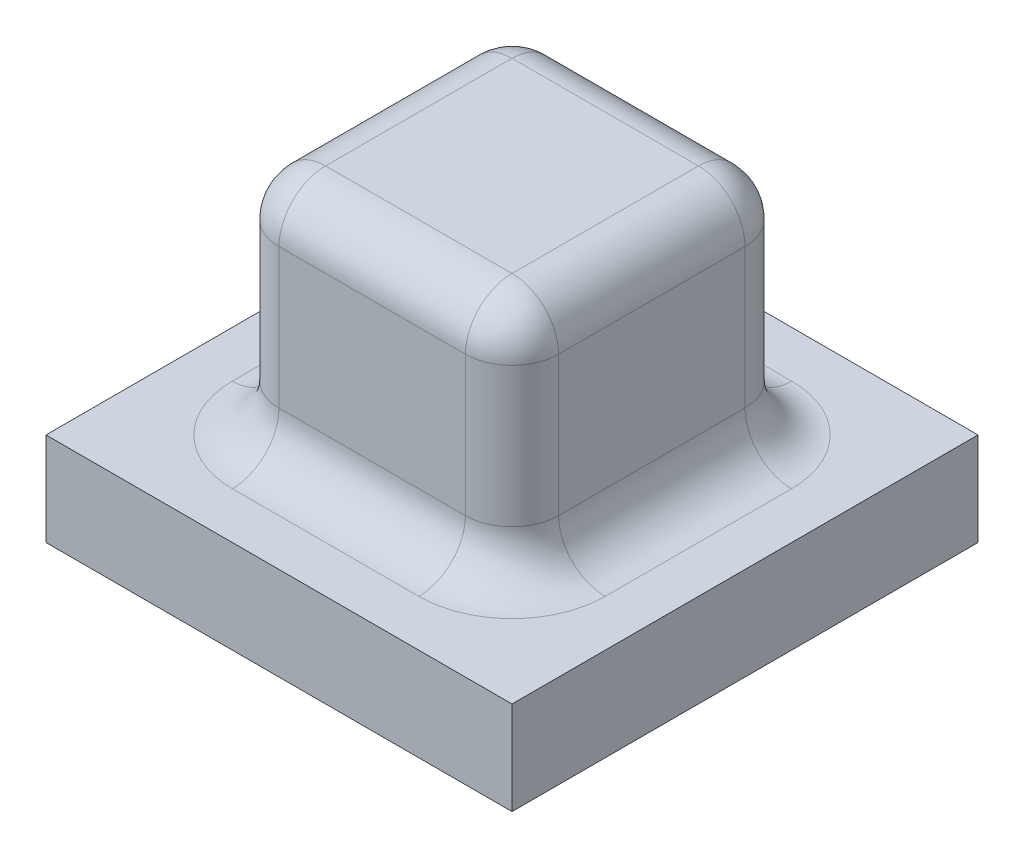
from build123d import *

# Parameters (mm, degrees)
SKETCH1_W      = 100
SKETCH1_H      = 20
EXTRUDE1_DEPTH = 50
SKETCH2_W      = 60
SKETCH2_H      = 60
EXTRUDE2_DEPTH = 50
FILLET6_R      = 10


with BuildPart() as part:
    # Sketch1 → Extrude1 (new, symmetric)
    with BuildSketch(Plane.XY):
        with Locations((0, 10)):
            Rectangle(SKETCH1_W, SKETCH1_H)
    extrude(amount=EXTRUDE1_DEPTH, both=True)

    # Sketch2 → Extrude2 (add)
    with BuildSketch(Plane(origin=(0, 20, 0), x_dir=(-1, 0, 0), z_dir=(0, 1, 0))):
        Rectangle(SKETCH2_W, SKETCH2_H)
    extrude(amount=EXTRUDE2_DEPTH)

    # Fillet6
    fillet6_edges = [part.edges().sort_by_distance(p)[0] for p in [
        (0, 20, 30),
        (-30, 20, 0),
        (0, 20, -30),
        (30, 20, 0),
        (30, 45, 30),
        (-30, 45, 30),
        (0, 70, 30),
        (-30, 45, -30),
        (-30, 70, 0),
        (30, 45, -30),
        (0, 70, -30),
        (30, 70, 0),
    ]]
    fillet(fillet6_edges, radius=FILLET6_R)


solid = part.part
